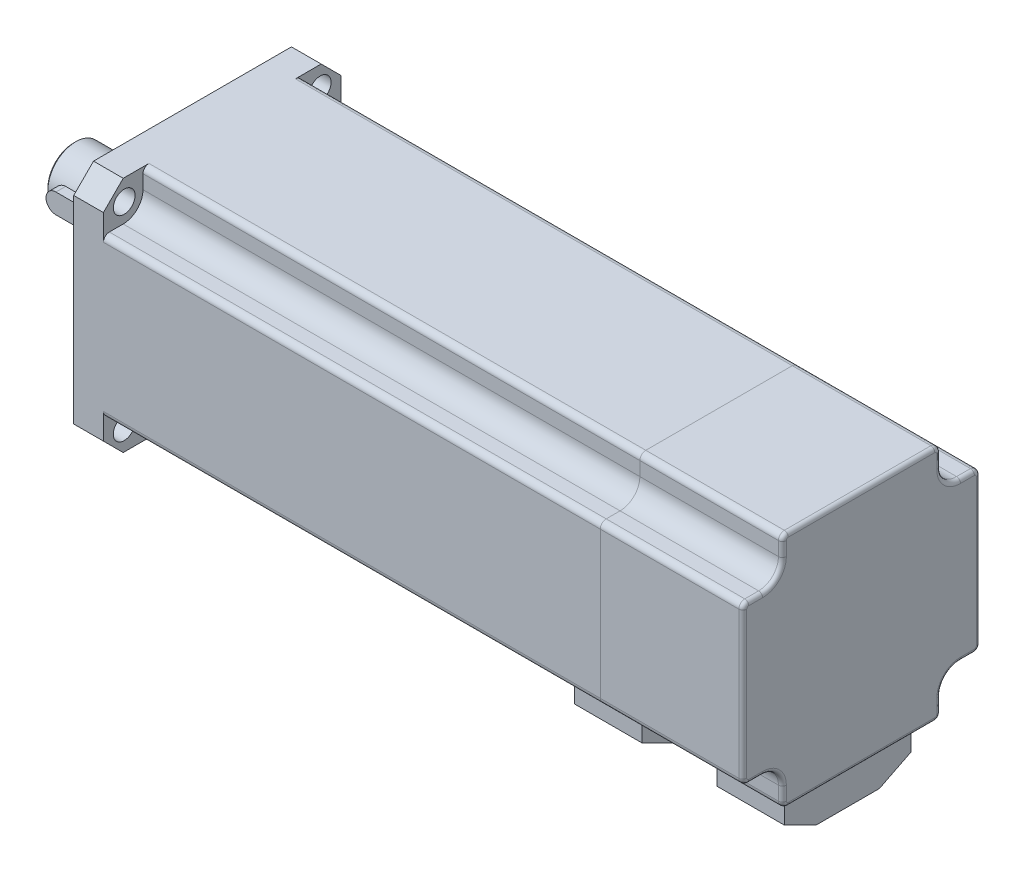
from build123d import *

# Parameters (mm, degrees)
EXTRUDE_1_DEPTH     = 133
EXTRUDE_2_DEPTH     = 36
CUT_EXTRUDE_1_DEPTH = 161.5
FILLET_1_R          = 1
SKETCH_4_R          = 2.75
CUT_EXTRUDE_2_DEPTH = 7.5
SKETCH_5_R          = 25
SKETCH_5_R_2        = 22.5
EXTRUDE_3_DEPTH     = 3
SKETCH_6_R          = 7.5
EXTRUDE_4_DEPTH     = 5
FILLET_2_R          = 0.5
SKETCH_7_R          = 7
EXTRUDE_5_DEPTH     = 25
CHAMFER_1_SIZE      = 0.5
CUT_EXTRUDE_3_DEPTH = 3
EXTRUDE_6_DEPTH     = 5
SKETCH_10_W         = 17
SKETCH_10_H         = 32
EXTRUDE_7_DEPTH     = 11
EXTRUDE_7_2_DEPTH   = 11
CUT_EXTRUDE_6_DEPTH = 53


with BuildPart() as part:
    # Sketch 1 → Extrude 1 (new body)
    with BuildSketch(Plane(origin=(0, 0, 0), x_dir=(0, 0, -1), z_dir=(1, 0, 0))):
        Polygon((-30, 25), (-25, 30), (25, 30), (30, 25), (30, -25), (25, -30), (-25, -30), (-30, -25), align=None)
    extrude(amount=EXTRUDE_1_DEPTH)


with BuildPart() as body_2:
    # Sketch 2 → Extrude 2 (new body)
    with BuildSketch(Plane(origin=(133, 0, 0), x_dir=(0, 0, -1), z_dir=(1, 0, 0))):
        Polygon((-25, -30), (25, -30), (30, -25), (30, 25), (25, 30), (-25, 30), (-30, 25), (-30, -25), align=None)
    extrude(amount=EXTRUDE_2_DEPTH)


with BuildPart() as cut_extrude_1_tool:
    # Sketch 3 → Cut-Extrude 1 (new body)
    with BuildSketch(Plane(origin=(169, 0, 0), x_dir=(0, 0, -1), z_dir=(1, 0, 0))):
        with BuildLine():
            Line((-25, 20), (-28.5, 20))
            ThreePointArc((-28.5, 20), (-29.560660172, 19.560660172), (-30, 18.5))
            Line((-30, 18.5), (-30, 25))
            Line((-30, 25), (-25, 30))
            Line((-25, 30), (-18.5, 30))
            ThreePointArc((-18.5, 30), (-19.560660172, 29.560660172), (-20, 28.5))
            Line((-20, 28.5), (-20, 25))
            ThreePointArc((-20, 25), (-21.464466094, 21.464466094), (-25, 20))
        make_face()
        with BuildLine():
            Line((18.5, 30), (25, 30))
            Line((25, 30), (30, 25))
            Line((30, 25), (30, 18.5))
            ThreePointArc((30, 18.5), (29.560660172, 19.560660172), (28.5, 20))
            Line((28.5, 20), (25, 20))
            ThreePointArc((25, 20), (21.464466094, 21.464466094), (20, 25))
            Line((20, 25), (20, 28.5))
            ThreePointArc((20, 28.5), (19.560660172, 29.560660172), (18.5, 30))
        make_face()
        with BuildLine():
            Line((-28.5, -20), (-25, -20))
            ThreePointArc((-25, -20), (-21.464466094, -21.464466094), (-20, -25))
            Line((-20, -25), (-20, -28.5))
            ThreePointArc((-20, -28.5), (-19.560660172, -29.560660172), (-18.5, -30))
            Line((-18.5, -30), (-25, -30))
            Line((-25, -30), (-30, -25))
            Line((-30, -25), (-30, -18.5))
            ThreePointArc((-30, -18.5), (-29.560660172, -19.560660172), (-28.5, -20))
        make_face()
        with BuildLine():
            Line((30, -18.5), (30, -25))
            Line((30, -25), (25, -30))
            Line((25, -30), (18.5, -30))
            ThreePointArc((18.5, -30), (19.560660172, -29.560660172), (20, -28.5))
            Line((20, -28.5), (20, -25))
            ThreePointArc((20, -25), (21.464466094, -21.464466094), (25, -20))
            Line((25, -20), (28.5, -20))
            ThreePointArc((28.5, -20), (29.560660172, -19.560660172), (30, -18.5))
        make_face()
    extrude(amount=-CUT_EXTRUDE_1_DEPTH)


with BuildPart() as part_1:
    add(part.part)

    # Cut-Extrude 1: cut by cut_extrude_1_tool
    add(cut_extrude_1_tool.part, mode=Mode.SUBTRACT)

    # Sketch 4 → Cut-Extrude 2 (cut)
    with BuildSketch(Plane.ZY):
        with Locations((-24.748737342, 24.748737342)):
            Circle(SKETCH_4_R)
        with Locations((24.748737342, 24.748737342)):
            Circle(SKETCH_4_R)
        with Locations((-24.748737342, -24.748737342)):
            Circle(SKETCH_4_R)
        with Locations((24.748737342, -24.748737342)):
            Circle(SKETCH_4_R)
    extrude(amount=-CUT_EXTRUDE_2_DEPTH, mode=Mode.SUBTRACT)



with BuildPart() as body_2_1:
    add(body_2.part)

    # Cut-Extrude 1: cut by cut_extrude_1_tool
    add(cut_extrude_1_tool.part, mode=Mode.SUBTRACT)

    # Fillet 1
    fillet_1_edges = [body_2_1.edges().sort_by_distance(p)[0] for p in [
        (169, 21.464466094, -21.464466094),
        (169, 20, -26.75),
        (169, 19.560660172, -29.560660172),
        (169, 29.560660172, -19.560660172),
        (169, 26.75, -20),
        (169, 0, 30),
        (169, -30, 0),
        (169, 0, -30),
        (169, 30, 0),
        (169, -19.560660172, 29.560660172),
        (169, -29.560660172, 19.560660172),
        (169, -26.75, 20),
        (169, -21.464466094, 21.464466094),
        (169, -20, 26.75),
        (169, 21.464466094, 21.464466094),
        (169, 26.75, 20),
        (169, 29.560660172, 19.560660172),
        (169, 19.560660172, 29.560660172),
        (169, 20, 26.75),
        (169, -21.464466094, -21.464466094),
        (169, -26.75, -20),
        (169, -29.560660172, -19.560660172),
        (169, -19.560660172, -29.560660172),
        (169, -20, -26.75),
    ]]
    fillet(fillet_1_edges, radius=FILLET_1_R)


with BuildPart() as body_3:
    # Sketch 5 → Extrude 3 (new body)
    with BuildSketch(Plane.ZY):
        Circle(SKETCH_5_R)
        Circle(SKETCH_5_R_2, mode=Mode.SUBTRACT)
    extrude(amount=EXTRUDE_3_DEPTH)


with BuildPart() as part_2:
    add(part_1.part)

    add(body_3.part)  # Extrude 4 merges body 3
    # Sketch 6 → Extrude 4 (add)
    with BuildSketch(Plane.ZY):
        Circle(SKETCH_6_R)
    extrude(amount=EXTRUDE_4_DEPTH)

    # Fillet 2
    fillet_2_edges = [part_2.edges().sort_by_distance(p)[0] for p in [
        (-5, 0, -7.5),
    ]]
    fillet(fillet_2_edges, radius=FILLET_2_R)

    # Sketch 7 → Extrude 5 (add)
    with BuildSketch(Plane.ZY.offset(5)):
        Circle(SKETCH_7_R)
    extrude(amount=EXTRUDE_5_DEPTH)

    # Chamfer 1
    chamfer_1_edges = [part_2.edges().sort_by_distance(p)[0] for p in [
        (-30, 0, -7),
    ]]
    chamfer(chamfer_1_edges, length=CHAMFER_1_SIZE)

    # Sketch 8 → Cut-Extrude 3 (cut)
    with BuildSketch(Plane.XY.offset(7)):
        with BuildLine():
            Line((-25.5, 2.5), (-10, 2.5))
            ThreePointArc((-10, 2.5), (-7.5, 0), (-10, -2.5))
            Line((-10, -2.5), (-25.5, -2.5))
            ThreePointArc((-25.5, -2.5), (-28, 0), (-25.5, 2.5))
        make_face()
    extrude(amount=-CUT_EXTRUDE_3_DEPTH, mode=Mode.SUBTRACT)


with BuildPart() as body_3_2:
    # Sketch 9 → Extrude 6 (new body)
    with BuildSketch(Plane.XY.offset(4)):
        with BuildLine():
            Line((-25.5, 2.5), (-10, 2.5))
            ThreePointArc((-10, 2.5), (-7.5, 0), (-10, -2.5))
            Line((-10, -2.5), (-25.5, -2.5))
            ThreePointArc((-25.5, -2.5), (-28, 0), (-25.5, 2.5))
        make_face()
    extrude(amount=EXTRUDE_6_DEPTH)


with BuildPart() as body_4:
    # Sketch 10 → Extrude 7 (new body)
    with BuildSketch(Plane(origin=(0, -30, 0), x_dir=(-1, 0, 0), z_dir=(0, -1, 0))):
        with Locations((-157, 0)):
            Rectangle(SKETCH_10_W, SKETCH_10_H)
    extrude(amount=EXTRUDE_7_DEPTH)


with BuildPart() as body_5:
    # Sketch 10 → Extrude 7 2 (new body)
    with BuildSketch(Plane(origin=(0, -30, 0), x_dir=(-1, 0, 0), z_dir=(0, -1, 0))):
        with Locations((-121, 0)):
            Rectangle(SKETCH_10_W, SKETCH_10_H)
    extrude(amount=EXTRUDE_7_2_DEPTH)


with BuildPart() as cut_extrude_6_tool:
    # Sketch 15 → Cut-Extrude 6 (new body)
    with BuildSketch(Plane.ZY.offset(-112.5)):
        Polygon((-16, -41), (-16, -37), (-8, -41), align=None)
        Polygon((16, -41), (8, -41), (16, -37), align=None)
    extrude(amount=-CUT_EXTRUDE_6_DEPTH)


with BuildPart() as body_4_1:
    add(body_4.part)

    # Cut-Extrude 6: cut by cut_extrude_6_tool
    add(cut_extrude_6_tool.part, mode=Mode.SUBTRACT)


with BuildPart() as body_5_1:
    add(body_5.part)

    # Cut-Extrude 6: cut by cut_extrude_6_tool
    add(cut_extrude_6_tool.part, mode=Mode.SUBTRACT)


solid = Compound([body_2_1.part, part_2.part, body_3_2.part, body_4_1.part, body_5_1.part])
